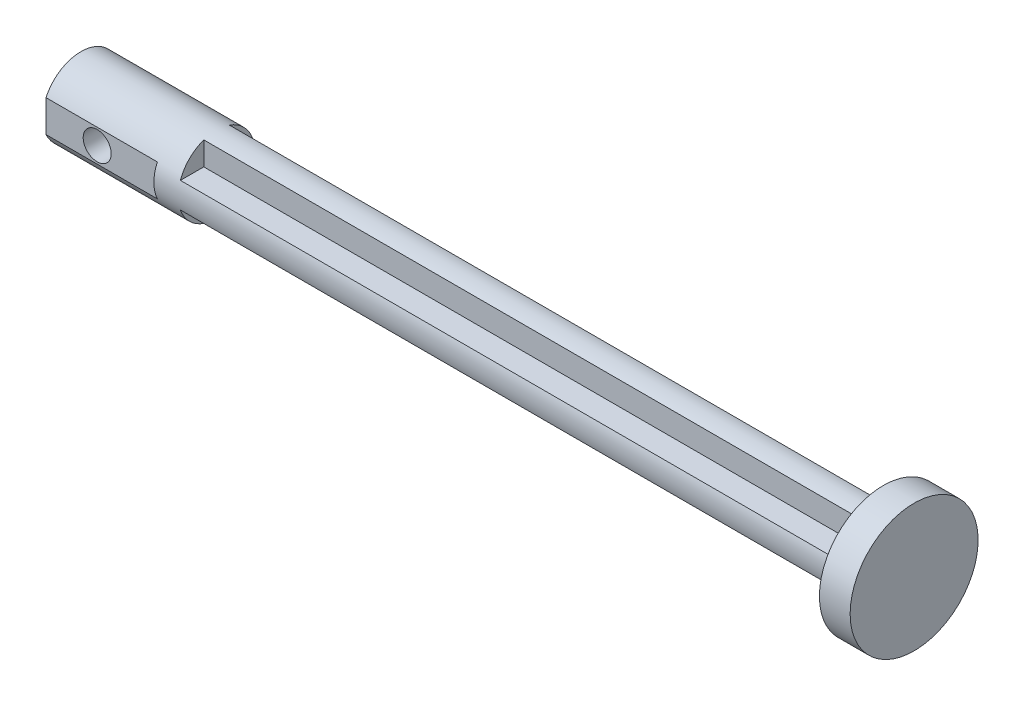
from build123d import *

# Parameters (mm, degrees)
SKETCH1_R           = 3.81
BASE_EXTRUDE_DEPTH  = 13.462
BOSS_EXTRUDE4_DEPTH = 66.167
SKETCH3_R           = 6.35
BOSS_EXTRUDE5_DEPTH = 3.048
CUT_EXTRUDE1_DEPTH  = 11.049
SKETCH5_R           = 1.3890625
CUT_EXTRUDE2_DEPTH  = 3.81


with BuildPart() as part:
    # Sketch1 → Base-Extrude (new body)
    with BuildSketch(Plane(origin=(0, 0, 0), x_dir=(0, 0, -1), z_dir=(1, 0, 0))):
        Circle(SKETCH1_R)
    extrude(amount=BASE_EXTRUDE_DEPTH)

    # Sketch2 → Boss-Extrude4 (add)
    with BuildSketch(Plane(origin=(13.462, 0, 0), x_dir=(0, 0, -1), z_dir=(1, 0, 0))):
        with BuildLine():
            Line((1.27, -3.592102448), (1.27, -1.27))
            Line((1.27, -1.27), (3.592102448, -1.27))
            ThreePointArc((3.592102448, -1.27), (3.81, 0), (3.592102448, 1.27))
            Line((3.592102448, 1.27), (1.27, 1.27))
            Line((1.27, 1.27), (1.27, 3.592102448))
            ThreePointArc((1.27, 3.592102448), (0, 3.81), (-1.27, 3.592102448))
            Line((-1.27, 3.592102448), (-1.27, 1.27))
            Line((-1.27, 1.27), (-3.592102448, 1.27))
            ThreePointArc((-3.592102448, 1.27), (-3.81, 0), (-3.592102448, -1.27))
            Line((-3.592102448, -1.27), (-1.27, -1.27))
            Line((-1.27, -1.27), (-1.27, -3.592102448))
            ThreePointArc((-1.27, -3.592102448), (0, -3.81), (1.27, -3.592102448))
        make_face()
    extrude(amount=BOSS_EXTRUDE4_DEPTH)

    # Sketch3 → Boss-Extrude5 (add)
    with BuildSketch(Plane(origin=(79.629, 0, 0), x_dir=(0, 0, -1), z_dir=(1, 0, 0))):
        with Locations(Location((0, 0, 0), (0, 0, 180))):
            Circle(SKETCH3_R)
    extrude(amount=BOSS_EXTRUDE5_DEPTH)

    # Sketch4 → Cut-Extrude1 (cut)
    with BuildSketch(Plane.ZY):
        with BuildLine():
            Line((3.463516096, 1.5875), (3.463516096, -1.5875))
            ThreePointArc((3.463516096, -1.5875), (3.81, 0), (3.463516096, 1.5875))
        make_face()
    extrude(amount=-CUT_EXTRUDE1_DEPTH, mode=Mode.SUBTRACT)

    # Sketch5 → Cut-Extrude2 (cut)
    with BuildSketch(Plane.XY.offset(3.463516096)):
        with Locations((5.08, 0)):
            Circle(SKETCH5_R)
    extrude(amount=-CUT_EXTRUDE2_DEPTH, mode=Mode.SUBTRACT)


solid = part.part
